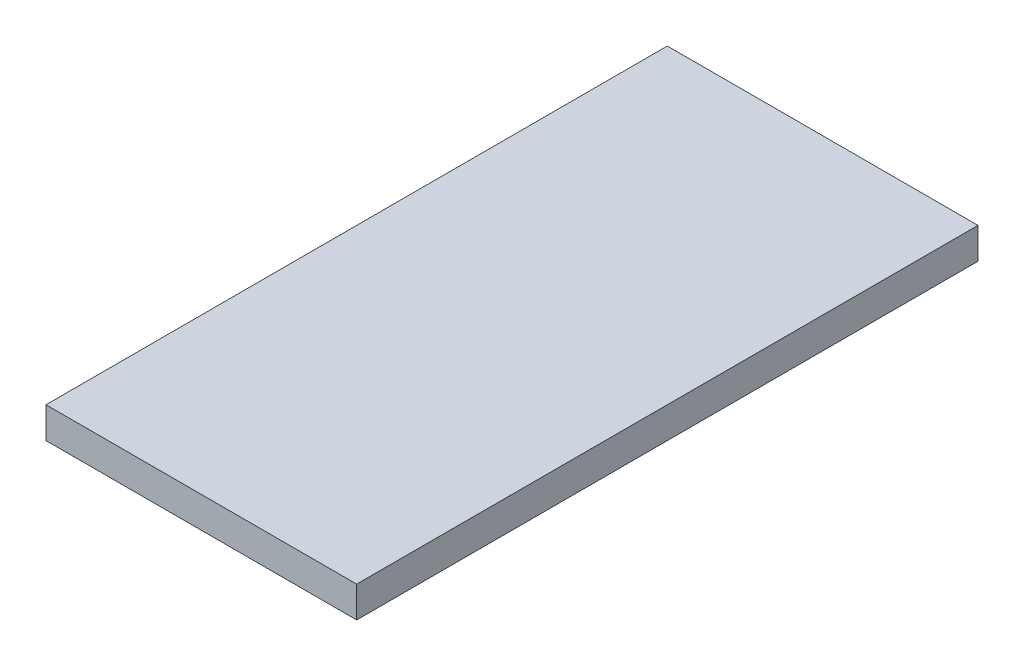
from build123d import *

# Parameters (mm, degrees)
SKETCH1_W      = 100
SKETCH1_H      = 10
EXTRUDE1_DEPTH = 100


with BuildPart() as part:
    # Sketch1 → Extrude1 (new, symmetric)
    with BuildSketch(Plane.XY):
        Rectangle(SKETCH1_W, SKETCH1_H)
    extrude(amount=EXTRUDE1_DEPTH, both=True)


solid = part.part
